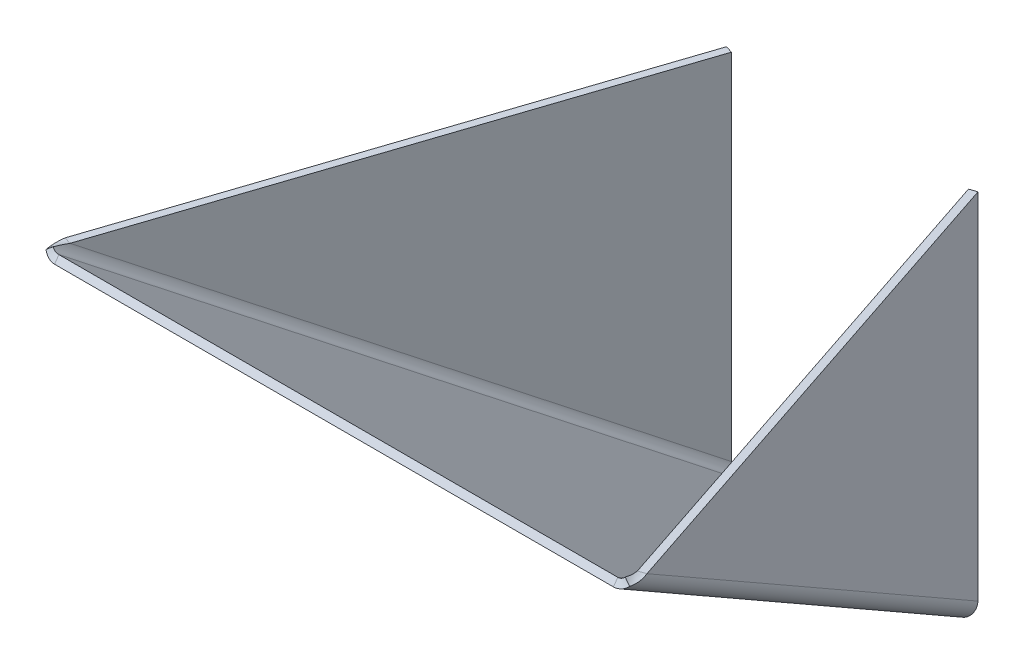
ISO-10303-21;
HEADER;
FILE_DESCRIPTION(('STEP AP214'),'2;1');
FILE_NAME('part.step','',(''),(''),'','','');
FILE_SCHEMA(('AUTOMOTIVE_DESIGN { 1 0 10303 214 1 1 1 1 }'));
ENDSEC;
DATA;
#1=APPLICATION_CONTEXT('core data for automotive mechanical design processes');
#2=APPLICATION_PROTOCOL_DEFINITION('international standard','automotive_design',2000,#1);
#3=PRODUCT_CONTEXT('',#1,'mechanical');
#4=PRODUCT('Part','Part','',(#3));
#5=PRODUCT_RELATED_PRODUCT_CATEGORY('part','',(#4));
#6=PRODUCT_DEFINITION_FORMATION('','',#4);
#7=PRODUCT_DEFINITION_CONTEXT('part definition',#1,'design');
#8=PRODUCT_DEFINITION('design','',#6,#7);
#9=PRODUCT_DEFINITION_SHAPE('','',#8);
#10=(LENGTH_UNIT() NAMED_UNIT(*) SI_UNIT(.MILLI.,.METRE.));
#11=(NAMED_UNIT(*) PLANE_ANGLE_UNIT() SI_UNIT($,.RADIAN.));
#12=(NAMED_UNIT(*) SI_UNIT($,.STERADIAN.) SOLID_ANGLE_UNIT());
#13=UNCERTAINTY_MEASURE_WITH_UNIT(LENGTH_MEASURE(1.E-05),#10,'distance_accuracy_value','');
#14=(GEOMETRIC_REPRESENTATION_CONTEXT(3) GLOBAL_UNCERTAINTY_ASSIGNED_CONTEXT((#13)) GLOBAL_UNIT_ASSIGNED_CONTEXT((#10,
#11,#12)) REPRESENTATION_CONTEXT('',''));
#15=CARTESIAN_POINT('',(0.,0.,0.));
#16=DIRECTION('',(0.,0.,1.));
#17=DIRECTION('',(1.,0.,0.));
#18=AXIS2_PLACEMENT_3D('',#15,#16,#17);
#19=CARTESIAN_POINT('',(-16.7,133.578332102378,-130.249591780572));
#20=DIRECTION('',(0.,-0.581238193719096,-0.813733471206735));
#21=DIRECTION('',(0.,0.813733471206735,-0.581238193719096));
#22=AXIS2_PLACEMENT_3D('',#19,#20,#21);
#23=PLANE('',#22);
#24=DIRECTION('',(-1.,0.,0.));
#25=VECTOR('',#24,1.);
#26=CARTESIAN_POINT('',(-16.7,-49.5848298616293,0.581238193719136));
#27=LINE('',#26,#25);
#28=CARTESIAN_POINT('',(14.3986465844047,-49.5848298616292,0.581238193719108));
#29=VERTEX_POINT('',#28);
#30=CARTESIAN_POINT('',(12.7,-49.5848298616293,0.581238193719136));
#31=VERTEX_POINT('',#30);
#32=EDGE_CURVE('E208',#29,#31,#27,.T.);
#33=ORIENTED_EDGE('',*,*,#32,.T.);
#34=DIRECTION('',(0.,0.813733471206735,-0.581238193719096));
#35=VECTOR('',#34,1.);
#36=CARTESIAN_POINT('',(12.7,-48.7710963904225,0.));
#37=LINE('',#36,#35);
#38=CARTESIAN_POINT('',(12.7,-48.7710963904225,0.));
#39=VERTEX_POINT('',#38);
#40=EDGE_CURVE('E67',#39,#31,#37,.F.);
#41=ORIENTED_EDGE('',*,*,#40,.F.);
#42=DIRECTION('',(1.,0.,0.));
#43=VECTOR('',#42,1.);
#44=CARTESIAN_POINT('',(-16.7,-48.7710963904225,0.));
#45=LINE('',#44,#43);
#46=CARTESIAN_POINT('',(14.3986465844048,-48.7710963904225,0.));
#47=VERTEX_POINT('',#46);
#48=EDGE_CURVE('E53',#39,#47,#45,.T.);
#49=ORIENTED_EDGE('',*,*,#48,.T.);
#50=DIRECTION('',(0.,-0.813733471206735,0.581238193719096));
#51=VECTOR('',#50,1.);
#52=CARTESIAN_POINT('',(14.3986465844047,133.578332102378,-130.249591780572));
#53=LINE('',#52,#51);
#54=EDGE_CURVE('E287',#47,#29,#53,.T.);
#55=ORIENTED_EDGE('',*,*,#54,.T.);
#56=EDGE_LOOP('',(#33,#41,#49,#55));
#57=FACE_BOUND('',#56,.T.);
#58=ADVANCED_FACE('F49',(#57),#23,.T.);
#59=CARTESIAN_POINT('',(-14.3986465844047,-48.7710963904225,0.));
#60=VERTEX_POINT('',#59);
#61=CARTESIAN_POINT('',(-12.7,-48.7710963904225,0.));
#62=VERTEX_POINT('',#61);
#63=EDGE_CURVE('E215',#60,#62,#45,.T.);
#64=ORIENTED_EDGE('',*,*,#63,.T.);
#65=DIRECTION('',(0.,0.813733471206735,-0.581238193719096));
#66=VECTOR('',#65,1.);
#67=CARTESIAN_POINT('',(-12.7,-48.7710963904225,0.));
#68=LINE('',#67,#66);
#69=CARTESIAN_POINT('',(-12.7,-49.5848298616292,0.581238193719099));
#70=VERTEX_POINT('',#69);
#71=EDGE_CURVE('E196',#62,#70,#68,.F.);
#72=ORIENTED_EDGE('',*,*,#71,.T.);
#73=CARTESIAN_POINT('',(-14.3986465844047,-49.5848298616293,0.58123819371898));
#74=VERTEX_POINT('',#73);
#75=EDGE_CURVE('E138',#70,#74,#27,.T.);
#76=ORIENTED_EDGE('',*,*,#75,.T.);
#77=DIRECTION('',(0.,-0.813733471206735,0.581238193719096));
#78=VECTOR('',#77,1.);
#79=CARTESIAN_POINT('',(-14.3986465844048,133.578332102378,-130.249591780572));
#80=LINE('',#79,#78);
#81=EDGE_CURVE('E272',#60,#74,#80,.T.);
#82=ORIENTED_EDGE('',*,*,#81,.F.);
#83=EDGE_LOOP('',(#64,#72,#76,#82));
#84=FACE_BOUND('',#83,.T.);
#85=ADVANCED_FACE('F832',(#84),#23,.T.);
#86=CARTESIAN_POINT('',(-16.7,-49.1862665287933,-0.581238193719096));
#87=DIRECTION('',(0.,-0.813733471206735,0.581238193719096));
#88=DIRECTION('',(0.,-0.581238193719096,-0.813733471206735));
#89=AXIS2_PLACEMENT_3D('',#86,#87,#88);
#90=PLANE('',#89);
#91=CARTESIAN_POINT('',(0.,-48.7710963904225,0.));
#92=DIRECTION('',(0.,-0.813733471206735,0.581238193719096));
#93=DIRECTION('',(0.,0.581238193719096,0.813733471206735));
#94=AXIS2_PLACEMENT_3D('',#91,#92,#93);
#95=ELLIPSE('',#94,15.6070758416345,12.7);
#96=EDGE_CURVE('E194',#39,#62,#95,.T.);
#97=ORIENTED_EDGE('',*,*,#96,.T.);
#98=ORIENTED_EDGE('',*,*,#63,.F.);
#99=DIRECTION('',(0.261436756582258,-0.561023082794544,-0.785432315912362));
#100=VECTOR('',#99,1.);
#101=CARTESIAN_POINT('',(-14.3986465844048,-48.7710963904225,0.));
#102=LINE('',#101,#100);
#103=CARTESIAN_POINT('',(-37.1259775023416,0.,68.2795349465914));
#104=VERTEX_POINT('',#103);
#105=EDGE_CURVE('E273',#104,#60,#102,.T.);
#106=ORIENTED_EDGE('',*,*,#105,.F.);
#107=DIRECTION('',(1.,0.,0.));
#108=VECTOR('',#107,1.);
#109=CARTESIAN_POINT('',(-16.7,0.,68.2795349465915));
#110=LINE('',#109,#108);
#111=CARTESIAN_POINT('',(37.1259775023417,0.,68.2795349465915));
#112=VERTEX_POINT('',#111);
#113=EDGE_CURVE('E216',#104,#112,#110,.T.);
#114=ORIENTED_EDGE('',*,*,#113,.T.);
#115=DIRECTION('',(0.261436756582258,0.561023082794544,0.785432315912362));
#116=VECTOR('',#115,1.);
#117=CARTESIAN_POINT('',(37.1259775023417,0.,68.2795349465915));
#118=LINE('',#117,#116);
#119=EDGE_CURVE('E214',#47,#112,#118,.T.);
#120=ORIENTED_EDGE('',*,*,#119,.F.);
#121=ORIENTED_EDGE('',*,*,#48,.F.);
#122=EDGE_LOOP('',(#97,#98,#106,#114,#120,#121));
#123=FACE_BOUND('',#122,.T.);
#124=ADVANCED_FACE('F211',(#123),#90,.F.);
#125=CARTESIAN_POINT('',(-16.7,-50.,0.));
#126=DIRECTION('',(0.,-0.813733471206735,0.581238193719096));
#127=DIRECTION('',(0.,-0.581238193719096,-0.813733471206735));
#128=AXIS2_PLACEMENT_3D('',#125,#126,#127);
#129=PLANE('',#128);
#130=ORIENTED_EDGE('',*,*,#75,.F.);
#131=CARTESIAN_POINT('',(0.,-49.5848298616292,0.581238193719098));
#132=DIRECTION('',(0.,-0.813733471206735,0.581238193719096));
#133=DIRECTION('',(0.,0.581238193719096,0.813733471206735));
#134=AXIS2_PLACEMENT_3D('',#131,#132,#133);
#135=ELLIPSE('',#134,15.6070758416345,12.7);
#136=EDGE_CURVE('E201',#31,#70,#135,.T.);
#137=ORIENTED_EDGE('',*,*,#136,.F.);
#138=ORIENTED_EDGE('',*,*,#32,.F.);
#139=DIRECTION('',(0.261436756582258,0.561023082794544,0.785432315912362));
#140=VECTOR('',#139,1.);
#141=CARTESIAN_POINT('',(37.1259775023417,-0.813733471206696,68.8607731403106));
#142=LINE('',#141,#140);
#143=CARTESIAN_POINT('',(37.1259775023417,-0.813733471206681,68.8607731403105));
#144=VERTEX_POINT('',#143);
#145=EDGE_CURVE('E224',#29,#144,#142,.T.);
#146=ORIENTED_EDGE('',*,*,#145,.T.);
#147=DIRECTION('',(-1.,0.,0.));
#148=VECTOR('',#147,1.);
#149=CARTESIAN_POINT('',(-16.7,-0.813733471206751,68.8607731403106));
#150=LINE('',#149,#148);
#151=CARTESIAN_POINT('',(-37.1259775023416,-0.813733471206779,68.8607731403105));
#152=VERTEX_POINT('',#151);
#153=EDGE_CURVE('E218',#144,#152,#150,.T.);
#154=ORIENTED_EDGE('',*,*,#153,.T.);
#155=DIRECTION('',(0.261436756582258,-0.561023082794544,-0.785432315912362));
#156=VECTOR('',#155,1.);
#157=CARTESIAN_POINT('',(-14.3986465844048,-49.5848298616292,0.581238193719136));
#158=LINE('',#157,#156);
#159=EDGE_CURVE('E279',#152,#74,#158,.T.);
#160=ORIENTED_EDGE('',*,*,#159,.T.);
#161=EDGE_LOOP('',(#130,#137,#138,#146,#154,#160));
#162=FACE_BOUND('',#161,.T.);
#163=ADVANCED_FACE('F443',(#162),#129,.T.);
#164=CARTESIAN_POINT('',(159.687318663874,0.,58.7117789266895));
#165=DIRECTION('',(0.315821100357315,0.,-0.948818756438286));
#166=DIRECTION('',(0.948818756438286,0.,0.315821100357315));
#167=AXIS2_PLACEMENT_3D('',#164,#165,#166);
#168=PLANE('',#167);
#169=DIRECTION('',(-0.948818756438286,0.,-0.315821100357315));
#170=VECTOR('',#169,1.);
#171=CARTESIAN_POINT('',(159.687318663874,-47.0910197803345,58.7117789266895));
#172=LINE('',#171,#170);
#173=CARTESIAN_POINT('',(-15.7511812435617,-47.0910197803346,0.315821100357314));
#174=VERTEX_POINT('',#173);
#175=CARTESIAN_POINT('',(-16.7,-47.0910197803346,0.));
#176=VERTEX_POINT('',#175);
#177=EDGE_CURVE('E876',#174,#176,#172,.T.);
#178=ORIENTED_EDGE('',*,*,#177,.T.);
#179=DIRECTION('',(0.,-1.,0.));
#180=VECTOR('',#179,1.);
#181=CARTESIAN_POINT('',(-16.7,0.,0.));
#182=LINE('',#181,#180);
#183=CARTESIAN_POINT('',(-16.7,0.,0.));
#184=VERTEX_POINT('',#183);
#185=EDGE_CURVE('E883',#184,#176,#182,.T.);
#186=ORIENTED_EDGE('',*,*,#185,.F.);
#187=DIRECTION('',(-0.948818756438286,0.,-0.315821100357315));
#188=VECTOR('',#187,1.);
#189=CARTESIAN_POINT('',(159.687318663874,0.,58.7117789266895));
#190=LINE('',#189,#188);
#191=CARTESIAN_POINT('',(-15.7511812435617,0.,0.315821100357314));
#192=VERTEX_POINT('',#191);
#193=EDGE_CURVE('E950',#192,#184,#190,.T.);
#194=ORIENTED_EDGE('',*,*,#193,.F.);
#195=DIRECTION('',(0.,1.,0.));
#196=VECTOR('',#195,1.);
#197=CARTESIAN_POINT('',(-15.7511812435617,0.,0.315821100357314));
#198=LINE('',#197,#196);
#199=EDGE_CURVE('E12',#174,#192,#198,.T.);
#200=ORIENTED_EDGE('',*,*,#199,.F.);
#201=EDGE_LOOP('',(#178,#186,#194,#200));
#202=FACE_BOUND('',#201,.T.);
#203=ADVANCED_FACE('F905',(#202),#168,.T.);
#204=CARTESIAN_POINT('',(-40.,0.,70.));
#205=DIRECTION('',(-0.948818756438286,0.,-0.315821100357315));
#206=DIRECTION('',(0.315821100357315,0.,-0.948818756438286));
#207=AXIS2_PLACEMENT_3D('',#204,#205,#206);
#208=PLANE('',#207);
#209=DIRECTION('',(0.261436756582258,-0.561023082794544,-0.785432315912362));
#210=VECTOR('',#209,1.);
#211=CARTESIAN_POINT('',(-16.7,-47.0910197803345,0.));
#212=LINE('',#211,#210);
#213=CARTESIAN_POINT('',(-38.644415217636,0.,65.9274276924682));
#214=VERTEX_POINT('',#213);
#215=EDGE_CURVE('E881',#214,#176,#212,.T.);
#216=ORIENTED_EDGE('',*,*,#215,.F.);
#217=DIRECTION('',(0.315821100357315,0.,-0.948818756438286));
#218=VECTOR('',#217,1.);
#219=CARTESIAN_POINT('',(-40.,0.,70.));
#220=LINE('',#219,#218);
#221=EDGE_CURVE('E91',#214,#184,#220,.T.);
#222=ORIENTED_EDGE('',*,*,#221,.T.);
#223=ORIENTED_EDGE('',*,*,#185,.T.);
#224=EDGE_LOOP('',(#216,#222,#223));
#225=FACE_BOUND('',#224,.T.);
#226=ADVANCED_FACE('F914',(#225),#208,.T.);
#227=CARTESIAN_POINT('',(136.387318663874,0.,128.71177892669));
#228=DIRECTION('',(0.,-1.,0.));
#229=DIRECTION('',(0.792810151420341,0.,-0.609468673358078));
#230=AXIS2_PLACEMENT_3D('',#227,#228,#229);
#231=PLANE('',#230);
#232=ORIENTED_EDGE('',*,*,#221,.F.);
#233=DIRECTION('',(-0.948818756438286,0.,-0.315821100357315));
#234=VECTOR('',#233,1.);
#235=CARTESIAN_POINT('',(137.742903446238,0.,124.639206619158));
#236=LINE('',#235,#234);
#237=CARTESIAN_POINT('',(-37.6955964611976,0.,66.2432487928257));
#238=VERTEX_POINT('',#237);
#239=EDGE_CURVE('E302',#238,#214,#236,.T.);
#240=ORIENTED_EDGE('',*,*,#239,.F.);
#241=DIRECTION('',(0.315821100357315,0.,-0.948818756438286));
#242=VECTOR('',#241,1.);
#243=CARTESIAN_POINT('',(-39.0511812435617,0.,70.3158211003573));
#244=LINE('',#243,#242);
#245=EDGE_CURVE('E966',#238,#192,#244,.T.);
#246=ORIENTED_EDGE('',*,*,#245,.T.);
#247=ORIENTED_EDGE('',*,*,#193,.T.);
#248=EDGE_LOOP('',(#232,#240,#246,#247));
#249=FACE_BOUND('',#248,.T.);
#250=ADVANCED_FACE('F952',(#249),#231,.F.);
#251=CARTESIAN_POINT('',(-39.0511812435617,0.,70.3158211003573));
#252=DIRECTION('',(-0.948818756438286,0.,-0.315821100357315));
#253=DIRECTION('',(0.315821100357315,0.,-0.948818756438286));
#254=AXIS2_PLACEMENT_3D('',#251,#252,#253);
#255=PLANE('',#254);
#256=ORIENTED_EDGE('',*,*,#245,.F.);
#257=DIRECTION('',(0.261436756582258,-0.561023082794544,-0.785432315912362));
#258=VECTOR('',#257,1.);
#259=CARTESIAN_POINT('',(-15.7511812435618,-47.0910197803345,0.315821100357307));
#260=LINE('',#259,#258);
#261=EDGE_CURVE('E59',#238,#174,#260,.T.);
#262=ORIENTED_EDGE('',*,*,#261,.T.);
#263=ORIENTED_EDGE('',*,*,#199,.T.);
#264=EDGE_LOOP('',(#256,#262,#263));
#265=FACE_BOUND('',#264,.T.);
#266=ADVANCED_FACE('F51',(#265),#255,.F.);
#267=CARTESIAN_POINT('',(-159.687318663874,0.,58.7117789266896));
#268=DIRECTION('',(0.,-1.,0.));
#269=DIRECTION('',(0.792810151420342,0.,0.609468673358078));
#270=AXIS2_PLACEMENT_3D('',#267,#268,#269);
#271=PLANE('',#270);
#272=DIRECTION('',(-0.315821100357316,0.,-0.948818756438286));
#273=VECTOR('',#272,1.);
#274=CARTESIAN_POINT('',(16.7,0.,0.));
#275=LINE('',#274,#273);
#276=CARTESIAN_POINT('',(38.644415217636,0.,65.9274276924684));
#277=VERTEX_POINT('',#276);
#278=CARTESIAN_POINT('',(16.7,0.,0.));
#279=VERTEX_POINT('',#278);
#280=EDGE_CURVE('E314',#277,#279,#275,.T.);
#281=ORIENTED_EDGE('',*,*,#280,.T.);
#282=DIRECTION('',(0.948818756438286,0.,-0.315821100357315));
#283=VECTOR('',#282,1.);
#284=CARTESIAN_POINT('',(-159.687318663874,0.,58.7117789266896));
#285=LINE('',#284,#283);
#286=CARTESIAN_POINT('',(15.7511812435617,0.,0.315821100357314));
#287=VERTEX_POINT('',#286);
#288=EDGE_CURVE('E821',#287,#279,#285,.T.);
#289=ORIENTED_EDGE('',*,*,#288,.F.);
#290=DIRECTION('',(-0.315821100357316,0.,-0.948818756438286));
#291=VECTOR('',#290,1.);
#292=CARTESIAN_POINT('',(15.7511812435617,0.,0.315821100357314));
#293=LINE('',#292,#291);
#294=CARTESIAN_POINT('',(37.6955964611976,0.,66.2432487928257));
#295=VERTEX_POINT('',#294);
#296=EDGE_CURVE('E121',#295,#287,#293,.T.);
#297=ORIENTED_EDGE('',*,*,#296,.F.);
#298=DIRECTION('',(0.948818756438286,0.,-0.315821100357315));
#299=VECTOR('',#298,1.);
#300=CARTESIAN_POINT('',(-137.742903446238,0.,124.639206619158));
#301=LINE('',#300,#299);
#302=EDGE_CURVE('E298',#295,#277,#301,.T.);
#303=ORIENTED_EDGE('',*,*,#302,.T.);
#304=EDGE_LOOP('',(#281,#289,#297,#303));
#305=FACE_BOUND('',#304,.T.);
#306=ADVANCED_FACE('F254',(#305),#271,.F.);
#307=CARTESIAN_POINT('',(16.7,0.,0.));
#308=DIRECTION('',(0.948818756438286,0.,-0.315821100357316));
#309=DIRECTION('',(0.315821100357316,0.,0.948818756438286));
#310=AXIS2_PLACEMENT_3D('',#307,#308,#309);
#311=PLANE('',#310);
#312=DIRECTION('',(0.261436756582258,0.561023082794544,0.785432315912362));
#313=VECTOR('',#312,1.);
#314=CARTESIAN_POINT('',(38.644415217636,0.,65.9274276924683));
#315=LINE('',#314,#313);
#316=CARTESIAN_POINT('',(16.7,-47.0910197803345,0.));
#317=VERTEX_POINT('',#316);
#318=EDGE_CURVE('E115',#317,#277,#315,.T.);
#319=ORIENTED_EDGE('',*,*,#318,.F.);
#320=DIRECTION('',(0.,-1.,0.));
#321=VECTOR('',#320,1.);
#322=CARTESIAN_POINT('',(16.7,0.,0.));
#323=LINE('',#322,#321);
#324=EDGE_CURVE('E317',#279,#317,#323,.T.);
#325=ORIENTED_EDGE('',*,*,#324,.F.);
#326=ORIENTED_EDGE('',*,*,#280,.F.);
#327=EDGE_LOOP('',(#319,#325,#326));
#328=FACE_BOUND('',#327,.T.);
#329=ADVANCED_FACE('F805',(#328),#311,.T.);
#330=CARTESIAN_POINT('',(-159.687318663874,0.,58.7117789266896));
#331=DIRECTION('',(-0.315821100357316,0.,-0.948818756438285));
#332=DIRECTION('',(-0.948818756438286,0.,0.315821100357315));
#333=AXIS2_PLACEMENT_3D('',#330,#331,#332);
#334=PLANE('',#333);
#335=ORIENTED_EDGE('',*,*,#288,.T.);
#336=ORIENTED_EDGE('',*,*,#324,.T.);
#337=DIRECTION('',(0.948818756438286,0.,-0.315821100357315));
#338=VECTOR('',#337,1.);
#339=CARTESIAN_POINT('',(-159.687318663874,-47.0910197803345,58.7117789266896));
#340=LINE('',#339,#338);
#341=CARTESIAN_POINT('',(15.7511812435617,-47.0910197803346,0.315821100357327));
#342=VERTEX_POINT('',#341);
#343=EDGE_CURVE('E282',#342,#317,#340,.T.);
#344=ORIENTED_EDGE('',*,*,#343,.F.);
#345=DIRECTION('',(0.,-1.,0.));
#346=VECTOR('',#345,1.);
#347=CARTESIAN_POINT('',(15.7511812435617,0.,0.315821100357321));
#348=LINE('',#347,#346);
#349=EDGE_CURVE('E101',#287,#342,#348,.T.);
#350=ORIENTED_EDGE('',*,*,#349,.F.);
#351=EDGE_LOOP('',(#335,#336,#344,#350));
#352=FACE_BOUND('',#351,.T.);
#353=ADVANCED_FACE('F796',(#352),#334,.T.);
#354=CARTESIAN_POINT('',(15.7511812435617,0.,0.315821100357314));
#355=DIRECTION('',(0.948818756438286,0.,-0.315821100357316));
#356=DIRECTION('',(0.315821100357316,0.,0.948818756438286));
#357=AXIS2_PLACEMENT_3D('',#354,#355,#356);
#358=PLANE('',#357);
#359=ORIENTED_EDGE('',*,*,#349,.T.);
#360=DIRECTION('',(0.261436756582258,0.561023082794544,0.785432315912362));
#361=VECTOR('',#360,1.);
#362=CARTESIAN_POINT('',(37.6955964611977,0.,66.2432487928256));
#363=LINE('',#362,#361);
#364=EDGE_CURVE('E303',#342,#295,#363,.T.);
#365=ORIENTED_EDGE('',*,*,#364,.T.);
#366=ORIENTED_EDGE('',*,*,#296,.T.);
#367=EDGE_LOOP('',(#359,#365,#366));
#368=FACE_BOUND('',#367,.T.);
#369=ADVANCED_FACE('F251',(#368),#358,.F.);
#370=CARTESIAN_POINT('',(-16.7,182.349428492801,-61.9700568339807));
#371=DIRECTION('',(0.,-0.581238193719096,-0.813733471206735));
#372=DIRECTION('',(0.,0.813733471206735,-0.581238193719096));
#373=AXIS2_PLACEMENT_3D('',#370,#371,#372);
#374=PLANE('',#373);
#375=ORIENTED_EDGE('',*,*,#153,.F.);
#376=DIRECTION('',(0.,-0.813733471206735,0.581238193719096));
#377=VECTOR('',#376,1.);
#378=CARTESIAN_POINT('',(37.1259775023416,182.349428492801,-61.9700568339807));
#379=LINE('',#378,#377);
#380=EDGE_CURVE('E233',#112,#144,#379,.T.);
#381=ORIENTED_EDGE('',*,*,#380,.F.);
#382=ORIENTED_EDGE('',*,*,#113,.F.);
#383=DIRECTION('',(0.,-0.813733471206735,0.581238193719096));
#384=VECTOR('',#383,1.);
#385=CARTESIAN_POINT('',(-37.1259775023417,182.349428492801,-61.9700568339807));
#386=LINE('',#385,#384);
#387=EDGE_CURVE('E265',#104,#152,#386,.T.);
#388=ORIENTED_EDGE('',*,*,#387,.T.);
#389=EDGE_LOOP('',(#375,#381,#382,#388));
#390=FACE_BOUND('',#389,.T.);
#391=ADVANCED_FACE('F240',(#390),#374,.F.);
#392=CARTESIAN_POINT('',(15.1811143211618,-49.4871323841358,0.454688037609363));
#393=CARTESIAN_POINT('',(15.4135760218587,-49.3834029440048,0.450097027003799));
#394=CARTESIAN_POINT('',(15.6315141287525,-49.2481219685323,0.427779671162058));
#395=CARTESIAN_POINT('',(16.0170657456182,-48.9224448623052,0.360551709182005));
#396=CARTESIAN_POINT('',(16.1845880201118,-48.7321008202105,0.315696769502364));
#397=CARTESIAN_POINT('',(16.453479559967,-48.3107109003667,0.218933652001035));
#398=CARTESIAN_POINT('',(16.5548024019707,-48.0797300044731,0.167087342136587));
#399=CARTESIAN_POINT('',(16.6830964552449,-47.5961340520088,0.0726902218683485));
#400=CARTESIAN_POINT('',(16.7100533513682,-47.3436183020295,0.0302032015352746));
#401=CARTESIAN_POINT('',(16.7,-47.0910197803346,0.));
#402=CARTESIAN_POINT('',(14.8107927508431,-48.6773714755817,-0.00044843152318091));
#403=CARTESIAN_POINT('',(14.942099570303,-48.5931487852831,0.0425595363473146));
#404=CARTESIAN_POINT('',(15.0661502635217,-48.4931503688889,0.0766996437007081));
#405=CARTESIAN_POINT('',(15.2890836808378,-48.2655959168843,0.133687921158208));
#406=CARTESIAN_POINT('',(15.3879236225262,-48.1380659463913,0.15656158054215));
#407=CARTESIAN_POINT('',(15.5525270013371,-47.8626550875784,0.198782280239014));
#408=CARTESIAN_POINT('',(15.6182672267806,-47.714806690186,0.218160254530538));
#409=CARTESIAN_POINT('',(15.7125718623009,-47.4082928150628,0.261563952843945));
#410=CARTESIAN_POINT('',(15.7411282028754,-47.2496747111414,0.28561883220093));
#411=CARTESIAN_POINT('',(15.7511812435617,-47.0910197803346,0.315821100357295));
#412=B_SPLINE_SURFACE_WITH_KNOTS('',1,3,((#392,#393,#394,#395,#396,#397,#398,#399,#400,#401),
(#402,#403,#404,#405,#406,#407,#408,#409,#410,#411)),.UNSPECIFIED.,.F.,.F.,.F.,(2,2),(4,2,2,2,
4),(0.,1.),(0.,0.25,0.5,0.75,1.),.UNSPECIFIED.);
#413=CARTESIAN_POINT('',(14.8107927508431,-48.6773714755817,-0.00044843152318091));
#414=CARTESIAN_POINT('',(15.1811143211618,-49.4871323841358,0.454688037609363));
#415=B_SPLINE_CURVE_WITH_KNOTS('',1,(#413,#414),.UNSPECIFIED.,.F.,.F.,(2,2),(0.,1.),.UNSPECIFIED.);
#416=CARTESIAN_POINT('',(14.8107927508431,-48.6773714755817,-0.000448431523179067));
#417=VERTEX_POINT('',#416);
#418=CARTESIAN_POINT('',(15.1811159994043,-49.4871316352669,0.454688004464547));
#419=VERTEX_POINT('',#418);
#420=EDGE_CURVE('E426',#417,#419,#415,.T.);
#421=CARTESIAN_POINT('',(14.8107927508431,-48.6773714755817,-0.00044843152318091));
#422=CARTESIAN_POINT('',(14.942099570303,-48.5931487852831,0.0425595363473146));
#423=CARTESIAN_POINT('',(15.0661502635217,-48.4931503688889,0.0766996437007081));
#424=CARTESIAN_POINT('',(15.2890836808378,-48.2655959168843,0.133687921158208));
#425=CARTESIAN_POINT('',(15.3879236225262,-48.1380659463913,0.15656158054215));
#426=CARTESIAN_POINT('',(15.5525270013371,-47.8626550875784,0.198782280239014));
#427=CARTESIAN_POINT('',(15.6182672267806,-47.714806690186,0.218160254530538));
#428=CARTESIAN_POINT('',(15.7125718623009,-47.4082928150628,0.261563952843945));
#429=CARTESIAN_POINT('',(15.7411282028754,-47.2496747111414,0.28561883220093));
#430=CARTESIAN_POINT('',(15.7511812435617,-47.0910197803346,0.315821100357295));
#431=B_SPLINE_CURVE_WITH_KNOTS('',3,(#421,#422,#423,#424,#425,#426,#427,#428,#429,#430),
.UNSPECIFIED.,.F.,.F.,(4,2,2,2,4),(0.,0.25,0.5,0.75,1.),.UNSPECIFIED.);
#432=EDGE_CURVE('E504',#417,#342,#431,.T.);
#433=CARTESIAN_POINT('',(16.7,-47.0910197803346,0.));
#434=CARTESIAN_POINT('',(16.7100533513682,-47.3436183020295,0.0302032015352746));
#435=CARTESIAN_POINT('',(16.6830964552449,-47.5961340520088,0.0726902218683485));
#436=CARTESIAN_POINT('',(16.5548024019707,-48.0797300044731,0.167087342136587));
#437=CARTESIAN_POINT('',(16.453479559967,-48.3107109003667,0.218933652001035));
#438=CARTESIAN_POINT('',(16.1845880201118,-48.7321008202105,0.315696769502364));
#439=CARTESIAN_POINT('',(16.0170657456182,-48.9224448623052,0.360551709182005));
#440=CARTESIAN_POINT('',(15.6315141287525,-49.2481219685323,0.427779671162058));
#441=CARTESIAN_POINT('',(15.4135760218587,-49.3834029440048,0.450097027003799));
#442=CARTESIAN_POINT('',(15.1811143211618,-49.4871323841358,0.454688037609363));
#443=B_SPLINE_CURVE_WITH_KNOTS('',3,(#433,#434,#435,#436,#437,#438,#439,#440,#441,#442),
.UNSPECIFIED.,.F.,.F.,(4,2,2,2,4),(0.,0.25,0.5,0.75,1.),.UNSPECIFIED.);
#444=EDGE_CURVE('E331',#419,#317,#443,.F.);
#445=ORIENTED_EDGE('',*,*,#420,.F.);
#446=ORIENTED_EDGE('',*,*,#432,.T.);
#447=ORIENTED_EDGE('',*,*,#343,.T.);
#448=ORIENTED_EDGE('',*,*,#444,.F.);
#449=EDGE_LOOP('',(#445,#446,#447,#448));
#450=FACE_BOUND('',#449,.T.);
#451=ADVANCED_FACE('F250',(#450),#412,.T.);
#452=CARTESIAN_POINT('',(38.644415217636,0.,65.9274276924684));
#453=CARTESIAN_POINT('',(38.7728637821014,-0.0569828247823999,66.3133246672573));
#454=CARTESIAN_POINT('',(38.8465692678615,-0.113844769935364,66.7172800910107));
#455=CARTESIAN_POINT('',(38.8855575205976,-0.189478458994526,67.53414976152));
#456=CARTESIAN_POINT('',(38.8508932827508,-0.208045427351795,67.9468232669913));
#457=CARTESIAN_POINT('',(38.7715531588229,-0.191601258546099,68.349436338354));
#458=CARTESIAN_POINT('',(37.6955964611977,0.,66.2432487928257));
#459=CARTESIAN_POINT('',(37.799645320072,0.0569793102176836,66.5558419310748));
#460=CARTESIAN_POINT('',(37.8763275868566,0.114009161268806,66.8774791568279));
#461=CARTESIAN_POINT('',(37.9754758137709,0.247123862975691,67.5252181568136));
#462=CARTESIAN_POINT('',(37.9979668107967,0.323303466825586,67.8512149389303));
#463=CARTESIAN_POINT('',(37.9981277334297,0.416994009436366,68.1721656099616));
#464=B_SPLINE_SURFACE_WITH_KNOTS('',1,3,((#452,#453,#454,#455,#456,#457),(#458,#459,#460,#461,
#462,#463)),.UNSPECIFIED.,.F.,.F.,.F.,(2,2),(4,2,4),(0.,1.),(0.,0.5,1.),.UNSPECIFIED.);
#465=CARTESIAN_POINT('',(37.6955964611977,0.,66.2432487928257));
#466=CARTESIAN_POINT('',(37.799645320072,0.0569793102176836,66.5558419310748));
#467=CARTESIAN_POINT('',(37.8763275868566,0.114009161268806,66.8774791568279));
#468=CARTESIAN_POINT('',(37.9754758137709,0.247123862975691,67.5252181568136));
#469=CARTESIAN_POINT('',(37.9979668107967,0.323303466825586,67.8512149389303));
#470=CARTESIAN_POINT('',(37.9981277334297,0.416994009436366,68.1721656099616));
#471=B_SPLINE_CURVE_WITH_KNOTS('',3,(#465,#466,#467,#468,#469,#470),.UNSPECIFIED.,.F.,.F.,(4,2,
4),(0.,0.5,1.),.UNSPECIFIED.);
#472=CARTESIAN_POINT('',(37.9981277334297,0.416994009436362,68.1721656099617));
#473=VERTEX_POINT('',#472);
#474=EDGE_CURVE('E558',#295,#473,#471,.T.);
#475=CARTESIAN_POINT('',(37.9981277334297,0.416994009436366,68.1721656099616));
#476=CARTESIAN_POINT('',(38.7715531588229,-0.191601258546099,68.349436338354));
#477=B_SPLINE_CURVE_WITH_KNOTS('',1,(#475,#476),.UNSPECIFIED.,.F.,.F.,(2,2),(0.,1.),.UNSPECIFIED.);
#478=CARTESIAN_POINT('',(38.771553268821,-0.191601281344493,68.349435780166));
#479=VERTEX_POINT('',#478);
#480=EDGE_CURVE('E339',#473,#479,#477,.T.);
#481=CARTESIAN_POINT('',(38.7715531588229,-0.191601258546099,68.349436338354));
#482=CARTESIAN_POINT('',(38.8508932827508,-0.208045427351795,67.9468232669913));
#483=CARTESIAN_POINT('',(38.8855575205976,-0.189478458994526,67.53414976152));
#484=CARTESIAN_POINT('',(38.8465692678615,-0.113844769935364,66.7172800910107));
#485=CARTESIAN_POINT('',(38.7728637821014,-0.0569828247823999,66.3133246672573));
#486=CARTESIAN_POINT('',(38.644415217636,0.,65.9274276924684));
#487=B_SPLINE_CURVE_WITH_KNOTS('',3,(#481,#482,#483,#484,#485,#486),.UNSPECIFIED.,.F.,.F.,(4,2,
4),(0.,0.5,1.),.UNSPECIFIED.);
#488=EDGE_CURVE('E327',#277,#479,#487,.F.);
#489=ORIENTED_EDGE('',*,*,#302,.F.);
#490=ORIENTED_EDGE('',*,*,#474,.T.);
#491=ORIENTED_EDGE('',*,*,#480,.T.);
#492=ORIENTED_EDGE('',*,*,#488,.F.);
#493=EDGE_LOOP('',(#489,#490,#491,#492));
#494=FACE_BOUND('',#493,.T.);
#495=ADVANCED_FACE('F335',(#494),#464,.T.);
#496=CARTESIAN_POINT('',(38.7715531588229,-0.191601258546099,68.349436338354));
#497=CARTESIAN_POINT('',(38.5761241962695,-0.400829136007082,68.4837768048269));
#498=CARTESIAN_POINT('',(38.3243052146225,-0.565196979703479,68.6048984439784));
#499=CARTESIAN_POINT('',(37.756741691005,-0.777623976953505,68.7852879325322));
#500=CARTESIAN_POINT('',(37.4415814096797,-0.825507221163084,68.8442898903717));
#501=CARTESIAN_POINT('',(37.1259775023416,-0.81373347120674,68.8607731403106));
#502=CARTESIAN_POINT('',(37.9981277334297,0.416994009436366,68.1721656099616));
#503=CARTESIAN_POINT('',(37.8921872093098,0.294723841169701,68.2146094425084));
#504=CARTESIAN_POINT('',(37.758049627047,0.19488684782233,68.2504636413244));
#505=CARTESIAN_POINT('',(37.4578137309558,0.0533640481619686,68.2912253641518));
#506=CARTESIAN_POINT('',(37.2920033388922,0.0117733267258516,68.2960176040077));
#507=CARTESIAN_POINT('',(37.1259775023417,0.,68.2795349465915));
#508=B_SPLINE_SURFACE_WITH_KNOTS('',1,3,((#496,#497,#498,#499,#500,#501),(#502,#503,#504,#505,
#506,#507)),.UNSPECIFIED.,.F.,.F.,.F.,(2,2),(4,2,4),(0.,1.),(0.,0.5,1.),.UNSPECIFIED.);
#509=CARTESIAN_POINT('',(37.9981277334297,0.416994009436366,68.1721656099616));
#510=CARTESIAN_POINT('',(37.8921872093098,0.294723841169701,68.2146094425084));
#511=CARTESIAN_POINT('',(37.758049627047,0.19488684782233,68.2504636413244));
#512=CARTESIAN_POINT('',(37.4578137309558,0.0533640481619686,68.2912253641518));
#513=CARTESIAN_POINT('',(37.2920033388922,0.0117733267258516,68.2960176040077));
#514=CARTESIAN_POINT('',(37.1259775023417,0.,68.2795349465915));
#515=B_SPLINE_CURVE_WITH_KNOTS('',3,(#509,#510,#511,#512,#513,#514),.UNSPECIFIED.,.F.,.F.,(4,2,
4),(0.,0.5,1.),.UNSPECIFIED.);
#516=EDGE_CURVE('E475',#473,#112,#515,.T.);
#517=CARTESIAN_POINT('',(37.1259775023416,-0.81373347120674,68.8607731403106));
#518=CARTESIAN_POINT('',(37.4415814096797,-0.825507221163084,68.8442898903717));
#519=CARTESIAN_POINT('',(37.756741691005,-0.777623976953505,68.7852879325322));
#520=CARTESIAN_POINT('',(38.3243052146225,-0.565196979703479,68.6048984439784));
#521=CARTESIAN_POINT('',(38.5761241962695,-0.400829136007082,68.4837768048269));
#522=CARTESIAN_POINT('',(38.7715531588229,-0.191601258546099,68.349436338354));
#523=B_SPLINE_CURVE_WITH_KNOTS('',3,(#517,#518,#519,#520,#521,#522),.UNSPECIFIED.,.F.,.F.,(4,2,
4),(0.,0.5,1.),.UNSPECIFIED.);
#524=EDGE_CURVE('E129',#479,#144,#523,.F.);
#525=ORIENTED_EDGE('',*,*,#480,.F.);
#526=ORIENTED_EDGE('',*,*,#516,.T.);
#527=ORIENTED_EDGE('',*,*,#380,.T.);
#528=ORIENTED_EDGE('',*,*,#524,.F.);
#529=EDGE_LOOP('',(#525,#526,#527,#528));
#530=FACE_BOUND('',#529,.T.);
#531=ADVANCED_FACE('F363',(#530),#508,.T.);
#532=CARTESIAN_POINT('',(14.3986465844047,-49.5848298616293,0.581238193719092));
#533=CARTESIAN_POINT('',(14.6661200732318,-49.5948080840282,0.567268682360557));
#534=CARTESIAN_POINT('',(14.9330424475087,-49.5622110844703,0.522954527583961));
#535=CARTESIAN_POINT('',(15.1811143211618,-49.4871323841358,0.454688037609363));
#536=CARTESIAN_POINT('',(14.3986465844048,-48.7710963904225,0.));
#537=CARTESIAN_POINT('',(14.5393509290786,-48.7611186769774,0.0139687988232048));
#538=CARTESIAN_POINT('',(14.6797887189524,-48.7298754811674,0.0127298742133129));
#539=CARTESIAN_POINT('',(14.8107927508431,-48.6773714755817,-0.00044843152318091));
#540=B_SPLINE_SURFACE_WITH_KNOTS('',1,3,((#532,#533,#534,#535),(#536,#537,#538,#539)),
.UNSPECIFIED.,.F.,.F.,.F.,(2,2),(4,4),(0.,1.),(0.,1.),.UNSPECIFIED.);
#541=CARTESIAN_POINT('',(14.3986465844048,-48.7710963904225,0.));
#542=CARTESIAN_POINT('',(14.5393509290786,-48.7611186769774,0.0139687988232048));
#543=CARTESIAN_POINT('',(14.6797887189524,-48.7298754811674,0.0127298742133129));
#544=CARTESIAN_POINT('',(14.8107927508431,-48.6773714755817,-0.00044843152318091));
#545=B_SPLINE_CURVE_WITH_KNOTS('',3,(#541,#542,#543,#544),.UNSPECIFIED.,.F.,.F.,(4,4),(0.,1.),.UNSPECIFIED.);
#546=EDGE_CURVE('E501',#47,#417,#545,.T.);
#547=CARTESIAN_POINT('',(15.1811143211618,-49.4871323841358,0.454688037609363));
#548=CARTESIAN_POINT('',(14.9330424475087,-49.5622110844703,0.522954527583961));
#549=CARTESIAN_POINT('',(14.6661200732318,-49.5948080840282,0.567268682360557));
#550=CARTESIAN_POINT('',(14.3986465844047,-49.5848298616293,0.581238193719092));
#551=B_SPLINE_CURVE_WITH_KNOTS('',3,(#547,#548,#549,#550),.UNSPECIFIED.,.F.,.F.,(4,4),(0.,1.),.UNSPECIFIED.);
#552=EDGE_CURVE('E1123',#29,#419,#551,.F.);
#553=ORIENTED_EDGE('',*,*,#546,.T.);
#554=ORIENTED_EDGE('',*,*,#420,.T.);
#555=ORIENTED_EDGE('',*,*,#552,.F.);
#556=ORIENTED_EDGE('',*,*,#54,.F.);
#557=EDGE_LOOP('',(#553,#554,#555,#556));
#558=FACE_BOUND('',#557,.T.);
#559=ADVANCED_FACE('F431',(#558),#540,.T.);
#560=CARTESIAN_POINT('',(76.5871245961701,85.4943066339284,186.251099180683));
#561=DIRECTION('',(-0.261436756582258,-0.561023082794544,-0.785432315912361));
#562=DIRECTION('',(0.,0.813733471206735,-0.581238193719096));
#563=AXIS2_PLACEMENT_3D('',#560,#561,#562);
#564=CYLINDRICAL_SURFACE('',#563,2.);
#565=ORIENTED_EDGE('',*,*,#145,.F.);
#566=ORIENTED_EDGE('',*,*,#552,.T.);
#567=ORIENTED_EDGE('',*,*,#444,.T.);
#568=ORIENTED_EDGE('',*,*,#318,.T.);
#569=ORIENTED_EDGE('',*,*,#488,.T.);
#570=ORIENTED_EDGE('',*,*,#524,.T.);
#571=EDGE_LOOP('',(#565,#566,#567,#568,#569,#570));
#572=FACE_BOUND('',#571,.T.);
#573=ADVANCED_FACE('F326',(#572),#564,.T.);
#574=CARTESIAN_POINT('',(76.5871245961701,85.4943066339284,186.251099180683));
#575=DIRECTION('',(-0.261436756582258,-0.561023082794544,-0.785432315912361));
#576=DIRECTION('',(0.,0.813733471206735,-0.581238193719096));
#577=AXIS2_PLACEMENT_3D('',#574,#575,#576);
#578=CYLINDRICAL_SURFACE('',#577,1.);
#579=ORIENTED_EDGE('',*,*,#119,.T.);
#580=ORIENTED_EDGE('',*,*,#516,.F.);
#581=ORIENTED_EDGE('',*,*,#474,.F.);
#582=ORIENTED_EDGE('',*,*,#364,.F.);
#583=ORIENTED_EDGE('',*,*,#432,.F.);
#584=ORIENTED_EDGE('',*,*,#546,.F.);
#585=EDGE_LOOP('',(#579,#580,#581,#582,#583,#584));
#586=FACE_BOUND('',#585,.T.);
#587=ADVANCED_FACE('F442',(#586),#578,.F.);
#588=CARTESIAN_POINT('',(-38.7715531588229,-0.191601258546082,68.349436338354));
#589=CARTESIAN_POINT('',(-38.8508932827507,-0.208045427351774,67.9468232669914));
#590=CARTESIAN_POINT('',(-38.8855575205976,-0.189478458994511,67.53414976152));
#591=CARTESIAN_POINT('',(-38.8465692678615,-0.113844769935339,66.7172800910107));
#592=CARTESIAN_POINT('',(-38.7728637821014,-0.0569828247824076,66.3133246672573));
#593=CARTESIAN_POINT('',(-38.6444152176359,0.,65.9274276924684));
#594=CARTESIAN_POINT('',(-37.9981277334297,0.416994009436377,68.1721656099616));
#595=CARTESIAN_POINT('',(-37.9979668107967,0.323303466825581,67.8512149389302));
#596=CARTESIAN_POINT('',(-37.9754758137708,0.247123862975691,67.5252181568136));
#597=CARTESIAN_POINT('',(-37.8763275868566,0.114009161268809,66.8774791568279));
#598=CARTESIAN_POINT('',(-37.7996453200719,0.0569793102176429,66.5558419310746));
#599=CARTESIAN_POINT('',(-37.6955964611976,0.,66.2432487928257));
#600=B_SPLINE_SURFACE_WITH_KNOTS('',1,3,((#588,#589,#590,#591,#592,#593),(#594,#595,#596,#597,
#598,#599)),.UNSPECIFIED.,.F.,.F.,.F.,(2,2),(4,2,4),(0.,1.),(0.,0.5,1.),.UNSPECIFIED.);
#601=CARTESIAN_POINT('',(-37.9981277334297,0.416994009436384,68.1721656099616));
#602=CARTESIAN_POINT('',(-38.7715531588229,-0.191601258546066,68.3494363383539));
#603=B_SPLINE_CURVE_WITH_KNOTS('',1,(#601,#602),.UNSPECIFIED.,.F.,.F.,(2,2),(0.,1.),.UNSPECIFIED.);
#604=CARTESIAN_POINT('',(-37.9981277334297,0.416994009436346,68.1721656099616));
#605=VERTEX_POINT('',#604);
#606=CARTESIAN_POINT('',(-38.771553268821,-0.191601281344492,68.349435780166));
#607=VERTEX_POINT('',#606);
#608=EDGE_CURVE('E559',#605,#607,#603,.T.);
#609=CARTESIAN_POINT('',(-37.9981277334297,0.416994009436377,68.1721656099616));
#610=CARTESIAN_POINT('',(-37.9979668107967,0.323303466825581,67.8512149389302));
#611=CARTESIAN_POINT('',(-37.9754758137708,0.247123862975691,67.5252181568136));
#612=CARTESIAN_POINT('',(-37.8763275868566,0.114009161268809,66.8774791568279));
#613=CARTESIAN_POINT('',(-37.7996453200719,0.0569793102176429,66.5558419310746));
#614=CARTESIAN_POINT('',(-37.6955964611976,0.,66.2432487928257));
#615=B_SPLINE_CURVE_WITH_KNOTS('',3,(#609,#610,#611,#612,#613,#614),.UNSPECIFIED.,.F.,.F.,(4,2,
4),(0.,0.5,1.),.UNSPECIFIED.);
#616=EDGE_CURVE('E585',#605,#238,#615,.T.);
#617=CARTESIAN_POINT('',(-38.6444152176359,0.,65.9274276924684));
#618=CARTESIAN_POINT('',(-38.7728637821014,-0.0569828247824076,66.3133246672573));
#619=CARTESIAN_POINT('',(-38.8465692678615,-0.113844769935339,66.7172800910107));
#620=CARTESIAN_POINT('',(-38.8855575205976,-0.189478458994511,67.53414976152));
#621=CARTESIAN_POINT('',(-38.8508932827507,-0.208045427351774,67.9468232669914));
#622=CARTESIAN_POINT('',(-38.7715531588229,-0.191601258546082,68.349436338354));
#623=B_SPLINE_CURVE_WITH_KNOTS('',3,(#617,#618,#619,#620,#621,#622),.UNSPECIFIED.,.F.,.F.,(4,2,
4),(0.,0.5,1.),.UNSPECIFIED.);
#624=EDGE_CURVE('E571',#607,#214,#623,.F.);
#625=ORIENTED_EDGE('',*,*,#608,.F.);
#626=ORIENTED_EDGE('',*,*,#616,.T.);
#627=ORIENTED_EDGE('',*,*,#239,.T.);
#628=ORIENTED_EDGE('',*,*,#624,.F.);
#629=EDGE_LOOP('',(#625,#626,#627,#628));
#630=FACE_BOUND('',#629,.T.);
#631=ADVANCED_FACE('F520',(#630),#600,.T.);
#632=CARTESIAN_POINT('',(-16.7,-47.0910197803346,0.));
#633=CARTESIAN_POINT('',(-16.7100533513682,-47.3436183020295,0.0302032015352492));
#634=CARTESIAN_POINT('',(-16.6830964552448,-47.5961340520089,0.0726902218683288));
#635=CARTESIAN_POINT('',(-16.5548024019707,-48.0797300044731,0.167087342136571));
#636=CARTESIAN_POINT('',(-16.453479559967,-48.3107109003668,0.218933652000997));
#637=CARTESIAN_POINT('',(-16.1845880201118,-48.7321008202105,0.315696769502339));
#638=CARTESIAN_POINT('',(-16.0170657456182,-48.9224448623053,0.360551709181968));
#639=CARTESIAN_POINT('',(-15.6315141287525,-49.2481219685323,0.427779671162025));
#640=CARTESIAN_POINT('',(-15.4135760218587,-49.3834029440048,0.450097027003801));
#641=CARTESIAN_POINT('',(-15.1811143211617,-49.4871323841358,0.454688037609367));
#642=CARTESIAN_POINT('',(-15.7511812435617,-47.0910197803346,0.315821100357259));
#643=CARTESIAN_POINT('',(-15.7411282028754,-47.2496747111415,0.285618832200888));
#644=CARTESIAN_POINT('',(-15.7125718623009,-47.4082928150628,0.261563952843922));
#645=CARTESIAN_POINT('',(-15.6182672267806,-47.714806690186,0.218160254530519));
#646=CARTESIAN_POINT('',(-15.5525270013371,-47.8626550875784,0.198782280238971));
#647=CARTESIAN_POINT('',(-15.3879236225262,-48.1380659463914,0.15656158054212));
#648=CARTESIAN_POINT('',(-15.2890836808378,-48.2655959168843,0.133687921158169));
#649=CARTESIAN_POINT('',(-15.0661502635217,-48.4931503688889,0.0766996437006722));
#650=CARTESIAN_POINT('',(-14.942099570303,-48.5931487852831,0.0425595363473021));
#651=CARTESIAN_POINT('',(-14.8107927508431,-48.6773714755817,-0.000448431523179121));
#652=B_SPLINE_SURFACE_WITH_KNOTS('',1,3,((#632,#633,#634,#635,#636,#637,#638,#639,#640,#641),
(#642,#643,#644,#645,#646,#647,#648,#649,#650,#651)),.UNSPECIFIED.,.F.,.F.,.F.,(2,2),(4,2,2,2,
4),(0.,1.),(0.,0.25,0.5,0.75,1.),.UNSPECIFIED.);
#653=CARTESIAN_POINT('',(-15.7511812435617,-47.0910197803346,0.315821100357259));
#654=CARTESIAN_POINT('',(-15.7411282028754,-47.2496747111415,0.285618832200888));
#655=CARTESIAN_POINT('',(-15.7125718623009,-47.4082928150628,0.261563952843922));
#656=CARTESIAN_POINT('',(-15.6182672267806,-47.714806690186,0.218160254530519));
#657=CARTESIAN_POINT('',(-15.5525270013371,-47.8626550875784,0.198782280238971));
#658=CARTESIAN_POINT('',(-15.3879236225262,-48.1380659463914,0.15656158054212));
#659=CARTESIAN_POINT('',(-15.2890836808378,-48.2655959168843,0.133687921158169));
#660=CARTESIAN_POINT('',(-15.0661502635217,-48.4931503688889,0.0766996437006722));
#661=CARTESIAN_POINT('',(-14.942099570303,-48.5931487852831,0.0425595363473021));
#662=CARTESIAN_POINT('',(-14.8107927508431,-48.6773714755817,-0.000448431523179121));
#663=B_SPLINE_CURVE_WITH_KNOTS('',3,(#653,#654,#655,#656,#657,#658,#659,#660,#661,#662),
.UNSPECIFIED.,.F.,.F.,(4,2,2,2,4),(0.,0.25,0.5,0.75,1.),.UNSPECIFIED.);
#664=CARTESIAN_POINT('',(-14.8107927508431,-48.6773714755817,-0.000448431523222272));
#665=VERTEX_POINT('',#664);
#666=EDGE_CURVE('E589',#174,#665,#663,.T.);
#667=CARTESIAN_POINT('',(-14.8107927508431,-48.6773714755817,-0.000448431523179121));
#668=CARTESIAN_POINT('',(-15.1811143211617,-49.4871323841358,0.454688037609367));
#669=B_SPLINE_CURVE_WITH_KNOTS('',1,(#667,#668),.UNSPECIFIED.,.F.,.F.,(2,2),(0.,1.),.UNSPECIFIED.);
#670=CARTESIAN_POINT('',(-15.1811159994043,-49.4871316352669,0.454688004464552));
#671=VERTEX_POINT('',#670);
#672=EDGE_CURVE('E560',#665,#671,#669,.T.);
#673=CARTESIAN_POINT('',(-15.1811143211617,-49.4871323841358,0.454688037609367));
#674=CARTESIAN_POINT('',(-15.4135760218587,-49.3834029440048,0.450097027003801));
#675=CARTESIAN_POINT('',(-15.6315141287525,-49.2481219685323,0.427779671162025));
#676=CARTESIAN_POINT('',(-16.0170657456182,-48.9224448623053,0.360551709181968));
#677=CARTESIAN_POINT('',(-16.1845880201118,-48.7321008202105,0.315696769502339));
#678=CARTESIAN_POINT('',(-16.453479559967,-48.3107109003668,0.218933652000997));
#679=CARTESIAN_POINT('',(-16.5548024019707,-48.0797300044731,0.167087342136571));
#680=CARTESIAN_POINT('',(-16.6830964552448,-47.5961340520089,0.0726902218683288));
#681=CARTESIAN_POINT('',(-16.7100533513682,-47.3436183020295,0.0302032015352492));
#682=CARTESIAN_POINT('',(-16.7,-47.0910197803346,0.));
#683=B_SPLINE_CURVE_WITH_KNOTS('',3,(#673,#674,#675,#676,#677,#678,#679,#680,#681,#682),
.UNSPECIFIED.,.F.,.F.,(4,2,2,2,4),(0.,0.25,0.5,0.75,1.),.UNSPECIFIED.);
#684=EDGE_CURVE('E577',#176,#671,#683,.F.);
#685=ORIENTED_EDGE('',*,*,#177,.F.);
#686=ORIENTED_EDGE('',*,*,#666,.T.);
#687=ORIENTED_EDGE('',*,*,#672,.T.);
#688=ORIENTED_EDGE('',*,*,#684,.F.);
#689=EDGE_LOOP('',(#685,#686,#687,#688));
#690=FACE_BOUND('',#689,.T.);
#691=ADVANCED_FACE('F700',(#690),#652,.T.);
#692=CARTESIAN_POINT('',(-15.1811143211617,-49.4871323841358,0.454688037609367));
#693=CARTESIAN_POINT('',(-14.9330424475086,-49.5622110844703,0.522954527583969));
#694=CARTESIAN_POINT('',(-14.6661200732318,-49.5948080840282,0.567268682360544));
#695=CARTESIAN_POINT('',(-14.3986465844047,-49.5848298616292,0.581238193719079));
#696=CARTESIAN_POINT('',(-14.8107927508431,-48.6773714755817,-0.000448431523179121));
#697=CARTESIAN_POINT('',(-14.6797887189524,-48.7298754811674,0.012729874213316));
#698=CARTESIAN_POINT('',(-14.5393509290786,-48.7611186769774,0.0139687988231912));
#699=CARTESIAN_POINT('',(-14.3986465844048,-48.7710963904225,0.));
#700=B_SPLINE_SURFACE_WITH_KNOTS('',1,3,((#692,#693,#694,#695),(#696,#697,#698,#699)),
.UNSPECIFIED.,.F.,.F.,.F.,(2,2),(4,4),(0.,1.),(0.,1.),.UNSPECIFIED.);
#701=CARTESIAN_POINT('',(-14.8107927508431,-48.6773714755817,-0.000448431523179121));
#702=CARTESIAN_POINT('',(-14.6797887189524,-48.7298754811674,0.012729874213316));
#703=CARTESIAN_POINT('',(-14.5393509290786,-48.7611186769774,0.0139687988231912));
#704=CARTESIAN_POINT('',(-14.3986465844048,-48.7710963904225,0.));
#705=B_SPLINE_CURVE_WITH_KNOTS('',3,(#701,#702,#703,#704),.UNSPECIFIED.,.F.,.F.,(4,4),(0.,1.),.UNSPECIFIED.);
#706=EDGE_CURVE('E594',#665,#60,#705,.T.);
#707=CARTESIAN_POINT('',(-14.3986465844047,-49.5848298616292,0.581238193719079));
#708=CARTESIAN_POINT('',(-14.6661200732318,-49.5948080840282,0.567268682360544));
#709=CARTESIAN_POINT('',(-14.9330424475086,-49.5622110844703,0.522954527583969));
#710=CARTESIAN_POINT('',(-15.1811143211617,-49.4871323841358,0.454688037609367));
#711=B_SPLINE_CURVE_WITH_KNOTS('',3,(#707,#708,#709,#710),.UNSPECIFIED.,.F.,.F.,(4,4),(0.,1.),.UNSPECIFIED.);
#712=EDGE_CURVE('E580',#671,#74,#711,.F.);
#713=ORIENTED_EDGE('',*,*,#672,.F.);
#714=ORIENTED_EDGE('',*,*,#706,.T.);
#715=ORIENTED_EDGE('',*,*,#81,.T.);
#716=ORIENTED_EDGE('',*,*,#712,.F.);
#717=EDGE_LOOP('',(#713,#714,#715,#716));
#718=FACE_BOUND('',#717,.T.);
#719=ADVANCED_FACE('F622',(#718),#700,.T.);
#720=CARTESIAN_POINT('',(-37.1259775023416,-0.813733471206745,68.8607731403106));
#721=CARTESIAN_POINT('',(-37.4415814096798,-0.825507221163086,68.8442898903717));
#722=CARTESIAN_POINT('',(-37.756741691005,-0.777623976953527,68.7852879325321));
#723=CARTESIAN_POINT('',(-38.3243052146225,-0.565196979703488,68.6048984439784));
#724=CARTESIAN_POINT('',(-38.5761241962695,-0.400829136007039,68.4837768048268));
#725=CARTESIAN_POINT('',(-38.7715531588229,-0.191601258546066,68.3494363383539));
#726=CARTESIAN_POINT('',(-37.1259775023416,0.,68.2795349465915));
#727=CARTESIAN_POINT('',(-37.2920033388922,0.0117733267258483,68.2960176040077));
#728=CARTESIAN_POINT('',(-37.4578137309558,0.0533640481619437,68.2912253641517));
#729=CARTESIAN_POINT('',(-37.758049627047,0.194886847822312,68.2504636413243));
#730=CARTESIAN_POINT('',(-37.8921872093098,0.294723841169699,68.2146094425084));
#731=CARTESIAN_POINT('',(-37.9981277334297,0.416994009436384,68.1721656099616));
#732=B_SPLINE_SURFACE_WITH_KNOTS('',1,3,((#720,#721,#722,#723,#724,#725),(#726,#727,#728,#729,
#730,#731)),.UNSPECIFIED.,.F.,.F.,.F.,(2,2),(4,2,4),(0.,1.),(0.,0.5,1.),.UNSPECIFIED.);
#733=CARTESIAN_POINT('',(-37.1259775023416,0.,68.2795349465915));
#734=CARTESIAN_POINT('',(-37.2920033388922,0.0117733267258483,68.2960176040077));
#735=CARTESIAN_POINT('',(-37.4578137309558,0.0533640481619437,68.2912253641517));
#736=CARTESIAN_POINT('',(-37.758049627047,0.194886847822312,68.2504636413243));
#737=CARTESIAN_POINT('',(-37.8921872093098,0.294723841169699,68.2146094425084));
#738=CARTESIAN_POINT('',(-37.9981277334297,0.416994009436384,68.1721656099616));
#739=B_SPLINE_CURVE_WITH_KNOTS('',3,(#733,#734,#735,#736,#737,#738),.UNSPECIFIED.,.F.,.F.,(4,2,
4),(0.,0.5,1.),.UNSPECIFIED.);
#740=EDGE_CURVE('E583',#104,#605,#739,.T.);
#741=CARTESIAN_POINT('',(-38.7715531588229,-0.191601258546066,68.3494363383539));
#742=CARTESIAN_POINT('',(-38.5761241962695,-0.400829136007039,68.4837768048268));
#743=CARTESIAN_POINT('',(-38.3243052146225,-0.565196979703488,68.6048984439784));
#744=CARTESIAN_POINT('',(-37.756741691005,-0.777623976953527,68.7852879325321));
#745=CARTESIAN_POINT('',(-37.4415814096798,-0.825507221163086,68.8442898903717));
#746=CARTESIAN_POINT('',(-37.1259775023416,-0.813733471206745,68.8607731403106));
#747=B_SPLINE_CURVE_WITH_KNOTS('',3,(#741,#742,#743,#744,#745,#746),.UNSPECIFIED.,.F.,.F.,(4,2,
4),(0.,0.5,1.),.UNSPECIFIED.);
#748=EDGE_CURVE('E565',#152,#607,#747,.F.);
#749=ORIENTED_EDGE('',*,*,#740,.T.);
#750=ORIENTED_EDGE('',*,*,#608,.T.);
#751=ORIENTED_EDGE('',*,*,#748,.F.);
#752=ORIENTED_EDGE('',*,*,#387,.F.);
#753=EDGE_LOOP('',(#749,#750,#751,#752));
#754=FACE_BOUND('',#753,.T.);
#755=ADVANCED_FACE('F521',(#754),#732,.T.);
#756=CARTESIAN_POINT('',(25.205394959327,-132.944576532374,-119.563337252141));
#757=DIRECTION('',(-0.261436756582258,0.561023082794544,0.785432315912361));
#758=DIRECTION('',(0.,-0.813733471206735,0.581238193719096));
#759=AXIS2_PLACEMENT_3D('',#756,#757,#758);
#760=CYLINDRICAL_SURFACE('',#759,2.);
#761=ORIENTED_EDGE('',*,*,#159,.F.);
#762=ORIENTED_EDGE('',*,*,#748,.T.);
#763=ORIENTED_EDGE('',*,*,#624,.T.);
#764=ORIENTED_EDGE('',*,*,#215,.T.);
#765=ORIENTED_EDGE('',*,*,#684,.T.);
#766=ORIENTED_EDGE('',*,*,#712,.T.);
#767=EDGE_LOOP('',(#761,#762,#763,#764,#765,#766));
#768=FACE_BOUND('',#767,.T.);
#769=ADVANCED_FACE('F611',(#768),#760,.T.);
#770=CARTESIAN_POINT('',(25.205394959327,-132.944576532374,-119.563337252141));
#771=DIRECTION('',(-0.261436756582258,0.561023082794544,0.785432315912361));
#772=DIRECTION('',(0.,-0.813733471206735,0.581238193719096));
#773=AXIS2_PLACEMENT_3D('',#770,#771,#772);
#774=CYLINDRICAL_SURFACE('',#773,1.);
#775=ORIENTED_EDGE('',*,*,#105,.T.);
#776=ORIENTED_EDGE('',*,*,#706,.F.);
#777=ORIENTED_EDGE('',*,*,#666,.F.);
#778=ORIENTED_EDGE('',*,*,#261,.F.);
#779=ORIENTED_EDGE('',*,*,#616,.F.);
#780=ORIENTED_EDGE('',*,*,#740,.F.);
#781=EDGE_LOOP('',(#775,#776,#777,#778,#779,#780));
#782=FACE_BOUND('',#781,.T.);
#783=ADVANCED_FACE('F621',(#782),#774,.F.);
#784=CARTESIAN_POINT('',(0.,-48.7710963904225,0.));
#785=DIRECTION('',(0.,-0.813733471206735,0.581238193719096));
#786=DIRECTION('',(0.,0.581238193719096,0.813733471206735));
#787=AXIS2_PLACEMENT_3D('',#784,#785,#786);
#788=ELLIPSE('',#787,15.6070758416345,12.7);
#789=DIRECTION('',(0.,-0.813733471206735,0.581238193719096));
#790=VECTOR('',#789,1.);
#791=SURFACE_OF_LINEAR_EXTRUSION('',#788,#790);
#792=ORIENTED_EDGE('',*,*,#71,.F.);
#793=ORIENTED_EDGE('',*,*,#96,.F.);
#794=ORIENTED_EDGE('',*,*,#40,.T.);
#795=ORIENTED_EDGE('',*,*,#136,.T.);
#796=EDGE_LOOP('',(#792,#793,#794,#795));
#797=FACE_BOUND('',#796,.T.);
#798=ADVANCED_FACE('F195',(#797),#791,.F.);
#799=CLOSED_SHELL('',(#58,#85,#124,#163,#203,#226,#250,#266,#306,#329,#353,#369,#391,#451,#495,
#531,#559,#573,#587,#631,#691,#719,#755,#769,#783,#798));
#800=MANIFOLD_SOLID_BREP('B2',#799);
#801=ADVANCED_BREP_SHAPE_REPRESENTATION('',(#18,#800),#14);
#802=SHAPE_DEFINITION_REPRESENTATION(#9,#801);
ENDSEC;
END-ISO-10303-21;
